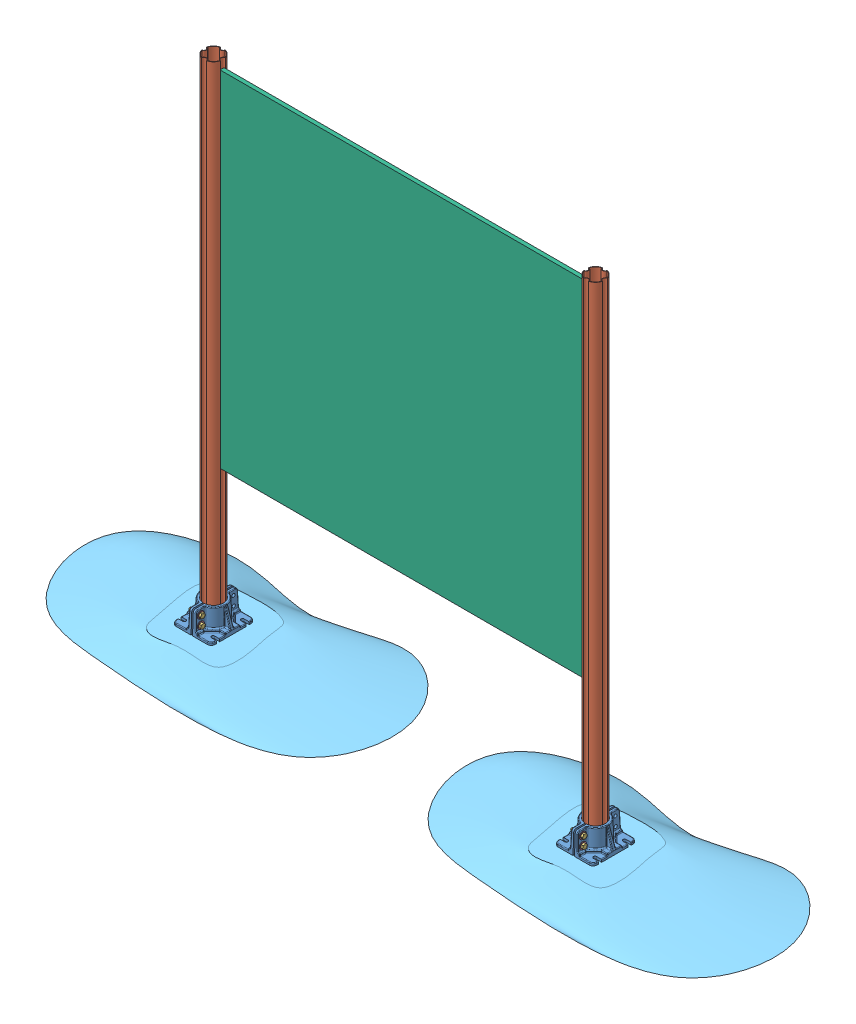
SolidWorks assembly Mise en Situation.SLDASM, configuration Défaut (file format 4100). Lengths in mm.
Overall size (2850.05 2054.22 679.75).
23 component instances, 6 part files, 7 mates.
Components (placement in the parent):
- Assemblage embase-1: Assemblage embase.SLDASM [Default] at origin size (1300.05 2054.22 679.75)
  - Embase de scellement-1: Embase de scellement.SLDPRT [Default] at origin size (75.77 90 176.29)
  - Mat-1: Mat.SLDPRT [Défaut] x (1 0 0) z (0 -1 0) size (76.47 76.47 2000)
  - Embase de scellement-2: Embase de scellement.SLDPRT [Default] x (-1 0 0) z (0 0 -1) size (75.77 90 176.29)
  - Goujon D12-1: Goujon D12.SLDPRT [Défaut] at (-1.2015 86.6726 -28.4517) x (0 0.830619 -0.556841) z (1 0 0) size (20.78 18 54.93)
  - Rondelle-1: Rondelle.SLDPRT [Défaut] at (16.6985 86.6726 -28.4517) x (0 -0.830619 0.556841) z (-1 0 0) size (27 27 2.5)
  - Rondelle-2: Rondelle.SLDPRT [Défaut] at (-14.2743 -26.2898 56.1708) x (0 0.606387 0.795169) z (-1 0 0) size (27 27 2.5)
  - Goujon D12-2: Goujon D12.SLDPRT [Défaut] at (-0.9613 -14.0147 -17.164) x (0 0.284854 -0.958571) z (1 0 0) size (20.78 18 54.93)
  - Rondelle-3: Rondelle.SLDPRT [Défaut] at (14.4387 -12.0049 152.2793) x (0 -0.307511 -0.951544) z (1 0 0) size (27 27 2.5)
  - Rondelle-4: Rondelle.SLDPRT [Défaut] at (-18.4487 29.052 163.7704) x (0 -0.686166 -0.727445) z (1 0 0) size (27 27 2.5)
  - Sol-1: Sol.SLDPRT [Défaut] x (1 0 0) z (0 -1 0) size (1300.05 679.75 54.23)
- Assemblage embase-2: Assemblage embase.SLDASM [Default] at (-1550 0 0) size (1300.05 2054.22 679.75)
  - Embase de scellement-1: Embase de scellement.SLDPRT [Default] at origin size (75.77 90 176.29)
  - Mat-1: Mat.SLDPRT [Défaut] x (1 0 0) z (0 -1 0) size (76.47 76.47 2000)
  - Embase de scellement-2: Embase de scellement.SLDPRT [Default] x (-1 0 0) z (0 0 -1) size (75.77 90 176.29)
  - Goujon D12-1: Goujon D12.SLDPRT [Défaut] at (-1.2015 86.6726 -28.4517) x (0 0.830619 -0.556841) z (1 0 0) size (20.78 18 54.93)
  - Rondelle-1: Rondelle.SLDPRT [Défaut] at (16.6985 86.6726 -28.4517) x (0 -0.830619 0.556841) z (-1 0 0) size (27 27 2.5)
  - Rondelle-2: Rondelle.SLDPRT [Défaut] at (-14.2743 -26.2898 56.1708) x (0 0.606387 0.795169) z (-1 0 0) size (27 27 2.5)
  - Goujon D12-2: Goujon D12.SLDPRT [Défaut] at (-0.9613 -14.0147 -17.164) x (0 0.284854 -0.958571) z (1 0 0) size (20.78 18 54.93)
  - Rondelle-3: Rondelle.SLDPRT [Défaut] at (14.4387 -12.0049 152.2793) x (0 -0.307511 -0.951544) z (1 0 0) size (27 27 2.5)
  - Rondelle-4: Rondelle.SLDPRT [Défaut] at (-18.4487 29.052 163.7704) x (0 -0.686166 -0.727445) z (1 0 0) size (27 27 2.5)
  - Sol-1: Sol.SLDPRT [Défaut] x (1 0 0) z (0 -1 0) size (1300.05 679.75 54.23)
- Panneau-1: Panneau.SLDPRT [Défaut] at origin size (1481 1400 16)
Mates (geometry in assembly coordinates):
- Coïncidente1: coincident aligned: plane of Assemblage embase-1/Embase de scellement-2 through (0 0 0) normal (0 -1 0); plane of Assemblage embase-2/Embase de scellement-1
- Coïncidente2: coincident aligned: plane of Assemblage embase-1; plane of Assemblage embase-2
- Distance1: distance = 1550 mm aligned: plane of Assemblage embase-1; plane of Assemblage embase-2
- Sur place1: in place: plane of assembly; plane of Panneau-1; moOrthogonalPlaneRef_w of assembly; plane of Panneau-1; moOrthogonalPlaneRef_w of assembly; plane of Panneau-1
- Coïncidente4: coincident aligned: plane of Panneau-1; plane of assembly
- Coïncidente5: coincident aligned: plane of Panneau-1; moOrthogonalPlaneRef_w of assembly
- Coïncidente6: coincident anti-aligned: plane of Panneau-1; moOrthogonalPlaneRef_w of assembly
